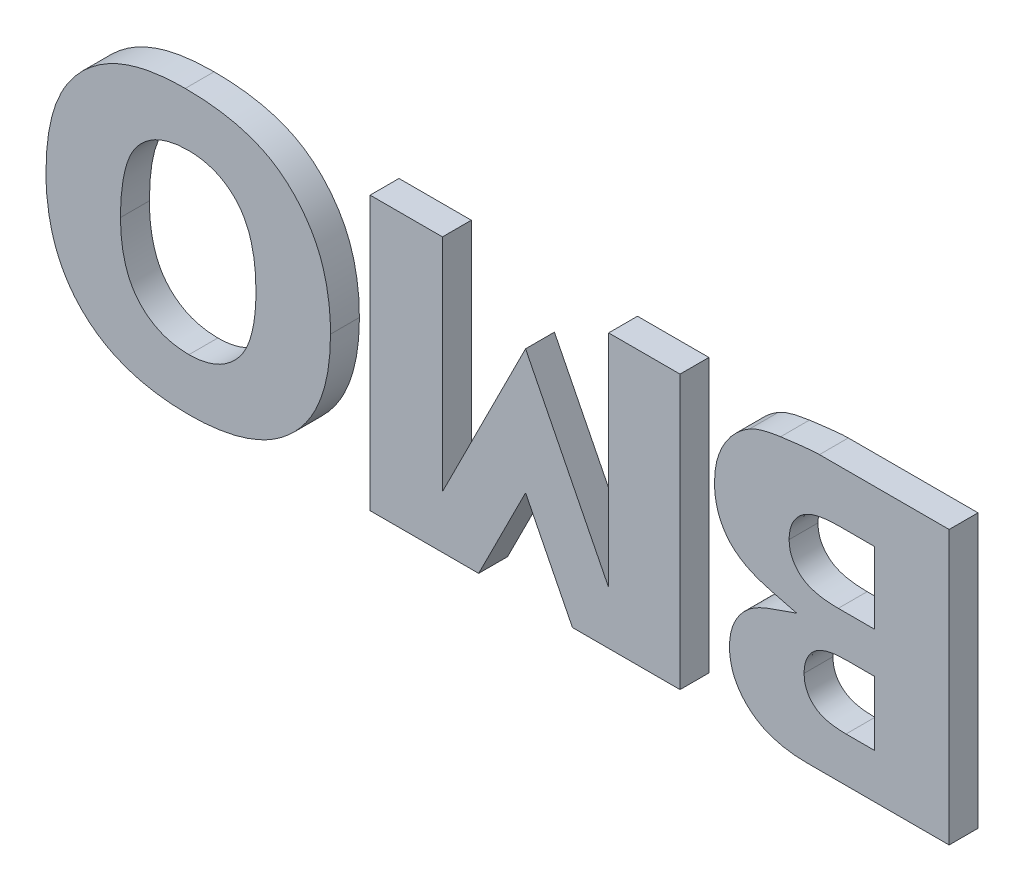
from build123d import *

# Parameters (mm, degrees)
BOSS_EXTRUDE1_DEPTH   = 1.905
BOSS_EXTRUDE1_2_DEPTH = 1.905
BOSS_EXTRUDE1_3_DEPTH = 1.905


with BuildPart() as part:
    # Sketch1 → Boss-Extrude1 (new body)
    with BuildSketch(Plane.XY):
        Polygon((-10.434858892, 29.6545), (-15.14635077, 29.6545), (-15.14635077, 15.099921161), (-20.628754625, 26.004552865), (-26.11073734, 15.100758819), (-26.113601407, 29.657575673), (-30.886935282, 29.657575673), (-30.886935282, 11.6205), (-23.723089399, 11.6205), (-20.628754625, 17.775205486), (-17.534419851, 11.6205), (-10.434858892, 11.6205), align=None)
    extrude(amount=BOSS_EXTRUDE1_DEPTH)


with BuildPart() as body_2:
    # Sketch1 → Boss-Extrude1 2 (new body)
    with BuildSketch(Plane.XY):
        with BuildLine():
            Line((7.324076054, 29.6545), (-1.232846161, 29.6545))
            add(Edge.make_bspline(
                [(-1.232846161, 29.6545), (-1.340451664, 29.652734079), (-1.448025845, 29.650456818), (-1.662660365, 29.637513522), (-1.769709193, 29.626659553), (-1.983964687, 29.607528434), (-2.091181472, 29.599042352), (-2.305176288, 29.577712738), (-2.411982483, 29.565233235), (-2.946001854, 29.502725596), (-3.372709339, 29.448541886), (-3.799192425, 29.392643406)],
                knots=[0, 0, 0, 0, 0.125, 0.125, 0.25, 0.25, 0.375, 0.375, 0.5, 0.5, 1, 1, 1, 1], degree=3))
            add(Edge.make_bspline(
                [(-3.799192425, 29.392643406), (-3.975707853, 29.366420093), (-4.152229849, 29.340236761), (-4.50347599, 29.276926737), (-4.677844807, 29.238639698), (-5.023145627, 29.149254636), (-5.195389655, 29.100743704), (-5.528733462, 28.978210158), (-5.68715284, 28.897015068), (-5.844918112, 28.814240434)],
                knots=[0, 0, 0, 0, 0.25, 0.25, 0.5, 0.5, 0.75, 0.75, 1, 1, 1, 1], degree=3))
            add(Edge.make_bspline(
                [(-5.844918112, 28.814240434), (-6.022643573, 28.700843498), (-6.200345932, 28.587419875), (-6.531611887, 28.332686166), (-6.685330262, 28.191554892), (-6.975239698, 27.8890438), (-7.112178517, 27.725868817), (-7.360003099, 27.384905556), (-7.471221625, 27.207585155), (-7.671080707, 26.840780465), (-7.759509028, 26.651181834), (-7.910483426, 26.258040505), (-7.973094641, 26.054163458), (-8.070425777, 25.645497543), (-8.105473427, 25.439126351), (-8.145486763, 25.02188151), (-8.152052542, 24.811247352), (-8.158667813, 24.600620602)],
                knots=[0, 0, 0, 0, 0.125, 0.125, 0.25, 0.25, 0.375, 0.375, 0.5, 0.5, 0.625, 0.625, 0.75, 0.75, 0.875, 0.875, 1, 1, 1, 1], degree=3))
            add(Edge.make_bspline(
                [(-8.158667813, 24.600620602), (-8.155423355, 24.433331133), (-8.151968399, 24.266074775), (-8.125448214, 23.934646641), (-8.103283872, 23.770333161), (-8.040581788, 23.444596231), (-8.000522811, 23.283097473), (-7.901749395, 22.963034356), (-7.842847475, 22.804611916), (-7.704246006, 22.50162102), (-7.626206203, 22.354894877), (-7.451536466, 22.071588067), (-7.350466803, 21.936377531), (-7.134260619, 21.67885318), (-7.019226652, 21.557844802), (-6.770300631, 21.33692521), (-6.637883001, 21.235364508), (-6.361585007, 21.045066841), (-6.218120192, 20.956278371), (-5.924164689, 20.799786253), (-5.773439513, 20.73035147), (-5.469092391, 20.598293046), (-5.314706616, 20.537465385), (-4.999740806, 20.430374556), (-4.839413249, 20.383441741), (-4.354226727, 20.252994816), (-4.02899144, 20.172973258), (-3.379948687, 20.007353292), (-3.05542731, 19.924543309), (-2.730905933, 19.841733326)],
                knots=[0, 0, 0, 0, 0.0625, 0.0625, 0.125, 0.125, 0.1875, 0.1875, 0.25, 0.25, 0.3125, 0.3125, 0.375, 0.375, 0.4375, 0.4375, 0.5, 0.5, 0.5625, 0.5625, 0.625, 0.625, 0.6875, 0.6875, 0.75, 0.75, 0.875, 0.875, 1, 1, 1, 1], degree=3))
            add(Edge.make_bspline(
                [(-2.730905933, 19.841733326), (-3.038815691, 19.733224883), (-3.346725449, 19.624716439), (-3.962544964, 19.407699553), (-4.271391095, 19.30179885), (-4.731289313, 19.133559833), (-4.883396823, 19.074016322), (-5.179220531, 18.93751505), (-5.323960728, 18.86129546), (-5.605113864, 18.696948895), (-5.741286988, 18.60901494), (-5.993355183, 18.406618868), (-6.109227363, 18.292126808), (-6.225249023, 18.177830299)],
                knots=[0, 0, 0, 0, 0.25, 0.25, 0.5, 0.5, 0.625, 0.625, 0.75, 0.75, 0.875, 0.875, 1, 1, 1, 1], degree=3))
            add(Edge.make_bspline(
                [(-6.225249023, 18.177830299), (-6.299789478, 18.092960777), (-6.374277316, 18.008051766), (-6.513898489, 17.831213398), (-6.578705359, 17.739039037), (-6.759970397, 17.452642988), (-6.859361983, 17.249825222), (-7.017937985, 16.8323127), (-7.077155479, 16.614810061), (-7.13476986, 16.280778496), (-7.149076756, 16.168986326), (-7.164799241, 15.944222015), (-7.166926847, 15.831315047), (-7.169083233, 15.718410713)],
                knots=[0, 0, 0, 0, 0.125, 0.125, 0.25, 0.25, 0.5, 0.5, 0.75, 0.75, 0.875, 0.875, 1, 1, 1, 1], degree=3))
            add(Edge.make_bspline(
                [(-7.169083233, 15.718410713), (-7.164949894, 15.562943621), (-7.160894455, 15.407463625), (-7.129626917, 15.100339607), (-7.103282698, 14.94855182), (-7.035273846, 14.64751412), (-6.993083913, 14.498146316), (-6.887720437, 14.203722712), (-6.824357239, 14.062922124), (-6.606316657, 13.657297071), (-6.433652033, 13.403198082), (-6.021978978, 12.935104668), (-5.792824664, 12.728765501), (-5.41658357, 12.457886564), (-5.284740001, 12.373846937), (-5.014258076, 12.222487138), (-4.875614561, 12.154982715), (-4.450597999, 11.974300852), (-4.153972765, 11.88105243), (-3.551541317, 11.739067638), (-3.247593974, 11.691694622), (-2.635737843, 11.631201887), (-2.327040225, 11.624902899), (-2.018123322, 11.6205)],
                knots=[0, 0, 0, 0, 0.0625, 0.0625, 0.125, 0.125, 0.1875, 0.1875, 0.25, 0.25, 0.375, 0.375, 0.5, 0.5, 0.5625, 0.5625, 0.625, 0.625, 0.75, 0.75, 0.875, 0.875, 1, 1, 1, 1], degree=3))
            Line((-2.018123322, 11.6205), (7.324076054, 11.6205))
            Line((7.324076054, 11.6205), (7.324076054, 29.6545))
        make_face()
        with BuildLine():
            Line((0.008809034, 21.490214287), (2.402413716, 21.490214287))
            Line((2.402413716, 21.490214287), (2.402413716, 26.217253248))
            Line((2.402413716, 26.217253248), (-0.003192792, 26.217253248))
            add(Edge.make_bspline(
                [(-0.003192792, 26.217253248), (-0.195005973, 26.214842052), (-0.386748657, 26.211812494), (-0.767862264, 26.184949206), (-0.957261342, 26.16136244), (-1.333348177, 26.090406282), (-1.522522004, 26.047652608), (-1.884598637, 25.924519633), (-2.057359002, 25.843305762), (-2.3838018, 25.636604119), (-2.529834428, 25.51465144), (-2.787438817, 25.233452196), (-2.898318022, 25.072688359), (-3.072020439, 24.733217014), (-3.138477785, 24.549932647), (-3.218617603, 24.176318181), (-3.228766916, 23.985120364), (-3.237822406, 23.793762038)],
                knots=[0, 0, 0, 0, 0.125, 0.125, 0.25, 0.25, 0.375, 0.375, 0.5, 0.5, 0.625, 0.625, 0.75, 0.75, 0.875, 0.875, 1, 1, 1, 1], degree=3))
            add(Edge.make_bspline(
                [(-3.237822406, 23.793762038), (-3.227447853, 23.605661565), (-3.215531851, 23.417820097), (-3.129949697, 23.052512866), (-3.05919665, 22.873294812), (-2.873160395, 22.549920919), (-2.757336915, 22.39996529), (-2.491597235, 22.131797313), (-2.34382411, 22.016530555), (-2.0161099, 21.826613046), (-1.841662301, 21.755444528), (-1.484775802, 21.643102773), (-1.300331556, 21.60175561), (-0.928709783, 21.541148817), (-0.742049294, 21.520941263), (-0.367481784, 21.49533872), (-0.179378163, 21.492279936), (0.008809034, 21.490214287)],
                knots=[0, 0, 0, 0, 0.125, 0.125, 0.25, 0.25, 0.375, 0.375, 0.5, 0.5, 0.625, 0.625, 0.75, 0.75, 0.875, 0.875, 1, 1, 1, 1], degree=3))
        make_face(mode=Mode.SUBTRACT)
        with BuildLine():
            Line((0.519570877, 14.56294156), (2.402413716, 14.56294156))
            Line((2.402413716, 14.56294156), (2.402413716, 18.795175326))
            Line((2.402413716, 18.795175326), (0.556506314, 18.795175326))
            add(Edge.make_bspline(
                [(0.556506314, 18.795175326), (0.220122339, 18.789857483), (-0.116200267, 18.777252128), (-0.614219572, 18.690310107), (-0.775309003, 18.647361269), (-1.090286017, 18.541004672), (-1.24362488, 18.474449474), (-1.529930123, 18.289956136), (-1.656218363, 18.179137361), (-1.877842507, 17.923413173), (-1.970344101, 17.780025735), (-2.115432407, 17.475827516), (-2.169418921, 17.312866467), (-2.233575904, 16.982835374), (-2.241382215, 16.812980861), (-2.247962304, 16.643492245)],
                knots=[0, 0, 0, 0, 0.25, 0.25, 0.375, 0.375, 0.5, 0.5, 0.625, 0.625, 0.75, 0.75, 0.875, 0.875, 1, 1, 1, 1], degree=3))
            add(Edge.make_bspline(
                [(-2.247962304, 16.643492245), (-2.241092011, 16.479436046), (-2.232848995, 16.315601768), (-2.166127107, 15.996054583), (-2.109971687, 15.837916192), (-1.961134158, 15.546246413), (-1.86709707, 15.40915654), (-1.646497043, 15.1647265), (-1.521439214, 15.05959425), (-1.10213305, 14.795282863), (-0.783608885, 14.697712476), (-0.136636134, 14.582283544), (0.191303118, 14.570903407), (0.519570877, 14.56294156)],
                knots=[0, 0, 0, 0, 0.125, 0.125, 0.25, 0.25, 0.375, 0.375, 0.5, 0.5, 0.75, 0.75, 1, 1, 1, 1], degree=3))
        make_face(mode=Mode.SUBTRACT)
    extrude(amount=BOSS_EXTRUDE1_2_DEPTH)


with BuildPart() as body_3:
    # Sketch1 → Boss-Extrude1 3 (new body)
    with BuildSketch(Plane.XY):
        with BuildLine():
            add(Edge.make_bspline(
                [(-43.089075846, 29.654456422), (-43.402321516, 29.649715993), (-43.71551268, 29.644608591), (-44.338058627, 29.60856462), (-44.64760656, 29.578928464), (-45.570999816, 29.454669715), (-46.180387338, 29.330034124), (-47.078272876, 29.034039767), (-47.372477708, 28.919099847), (-47.94108624, 28.658627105), (-48.216901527, 28.512713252), (-48.749440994, 28.185628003), (-49.006068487, 28.002658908), (-49.502319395, 27.612185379), (-49.734512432, 27.402668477), (-50.166847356, 26.954907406), (-50.369000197, 26.718465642), (-50.744392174, 26.219666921), (-50.917771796, 25.954762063), (-51.232825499, 25.410944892), (-51.369431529, 25.130248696), (-51.612455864, 24.556176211), (-51.717371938, 24.262168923), (-51.894094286, 23.660246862), (-51.968059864, 23.353054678), (-52.088726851, 22.738513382), (-52.136427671, 22.429822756), (-52.210844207, 21.810082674), (-52.23606837, 21.498865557), (-52.266842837, 20.874219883), (-52.272039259, 20.560751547), (-52.277060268, 20.247263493)],
                knots=[0, 0, 0, 0, 0.0625, 0.0625, 0.125, 0.125, 0.25, 0.25, 0.3125, 0.3125, 0.375, 0.375, 0.4375, 0.4375, 0.5, 0.5, 0.5625, 0.5625, 0.625, 0.625, 0.6875, 0.6875, 0.75, 0.75, 0.8125, 0.8125, 0.875, 0.875, 0.9375, 0.9375, 1, 1, 1, 1], degree=3))
            add(Edge.make_bspline(
                [(-52.277060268, 20.247263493), (-52.271831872, 19.93581922), (-52.266599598, 19.624375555), (-52.231014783, 19.005433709), (-52.198755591, 18.698234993), (-52.066562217, 17.782201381), (-51.936811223, 17.178049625), (-51.639490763, 16.287951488), (-51.523847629, 15.995465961), (-51.261758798, 15.431601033), (-51.114654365, 15.158590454), (-50.787742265, 14.630737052), (-50.607832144, 14.375385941), (-50.211194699, 13.887460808), (-49.998643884, 13.659782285), (-49.549700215, 13.231704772), (-49.312936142, 13.03173052), (-48.812440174, 12.662637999), (-48.547300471, 12.492138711), (-47.728289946, 12.03212386), (-47.152821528, 11.79626023), (-46.255153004, 11.525306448), (-45.94971348, 11.449373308), (-45.338355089, 11.324975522), (-45.031210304, 11.275273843), (-44.414527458, 11.196278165), (-44.104844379, 11.168220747), (-43.482615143, 11.136519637), (-43.17027293, 11.131136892), (-42.857929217, 11.125766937)],
                knots=[0, 0, 0, 0, 0.0625, 0.0625, 0.125, 0.125, 0.25, 0.25, 0.3125, 0.3125, 0.375, 0.375, 0.4375, 0.4375, 0.5, 0.5, 0.5625, 0.5625, 0.625, 0.625, 0.75, 0.75, 0.8125, 0.8125, 0.875, 0.875, 0.9375, 0.9375, 1, 1, 1, 1], degree=3))
            add(Edge.make_bspline(
                [(-42.857929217, 11.125766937), (-42.545504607, 11.130929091), (-42.233081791, 11.136103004), (-41.611846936, 11.170125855), (-41.303327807, 11.200895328), (-40.383111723, 11.328225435), (-39.775819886, 11.453669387), (-38.879733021, 11.739209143), (-38.584361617, 11.850446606), (-38.012850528, 12.101176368), (-37.734630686, 12.240519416), (-37.196876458, 12.553865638), (-36.938053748, 12.729188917), (-36.438250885, 13.112932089), (-36.20001838, 13.318222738), (-35.531722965, 13.971629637), (-35.144665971, 14.461828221), (-34.488283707, 15.539042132), (-34.234808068, 16.108935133), (-33.941640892, 17.00022402), (-33.858001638, 17.304668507), (-33.719518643, 17.916747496), (-33.664424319, 18.224442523), (-33.579611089, 18.842802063), (-33.550237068, 19.153506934), (-33.5150804, 19.77767739), (-33.508027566, 20.090994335), (-33.500990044, 20.404313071)],
                knots=[0, 0, 0, 0, 0.0625, 0.0625, 0.125, 0.125, 0.25, 0.25, 0.3125, 0.3125, 0.375, 0.375, 0.4375, 0.4375, 0.5, 0.5, 0.625, 0.625, 0.75, 0.75, 0.8125, 0.8125, 0.875, 0.875, 0.9375, 0.9375, 1, 1, 1, 1], degree=3))
            add(Edge.make_bspline(
                [(-33.500990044, 20.404313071), (-33.504846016, 20.721659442), (-33.509171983, 21.038930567), (-33.548108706, 21.668624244), (-33.580265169, 21.981439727), (-33.7113677, 22.914341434), (-33.845968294, 23.528719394), (-34.14771378, 24.434301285), (-34.265325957, 24.733047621), (-34.535833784, 25.305342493), (-34.68988409, 25.580618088), (-35.024114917, 26.116055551), (-35.205462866, 26.375542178), (-35.604142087, 26.873702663), (-35.81892066, 27.109790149), (-36.268800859, 27.553447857), (-36.505443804, 27.761505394), (-37.00693018, 28.144435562), (-37.273281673, 28.31799749), (-38.111617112, 28.789628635), (-38.701349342, 29.021014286), (-39.619168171, 29.278653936), (-39.931202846, 29.35130091), (-40.556983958, 29.470085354), (-40.871162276, 29.516551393), (-41.501427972, 29.590320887), (-41.817657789, 29.61619458), (-42.452211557, 29.646921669), (-42.770628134, 29.650845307), (-43.089075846, 29.654456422)],
                knots=[0, 0, 0, 0, 0.0625, 0.0625, 0.125, 0.125, 0.25, 0.25, 0.3125, 0.3125, 0.375, 0.375, 0.4375, 0.4375, 0.5, 0.5, 0.5625, 0.5625, 0.625, 0.625, 0.75, 0.75, 0.8125, 0.8125, 0.875, 0.875, 0.9375, 0.9375, 1, 1, 1, 1], degree=3))
        make_face()
        with BuildLine():
            add(Edge.make_bspline(
                [(-38.422553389, 20.401693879), (-38.426323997, 20.750421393), (-38.432183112, 21.098900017), (-38.487099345, 21.79070933), (-38.531477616, 22.134597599), (-38.629317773, 22.646703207), (-38.667221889, 22.816774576), (-38.75503709, 23.155486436), (-38.80516785, 23.323873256), (-38.923808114, 23.651186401), (-38.992453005, 23.810725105), (-39.145042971, 24.123045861), (-39.22892354, 24.275971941), (-39.51622898, 24.718301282), (-39.745921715, 24.976560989), (-40.135117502, 25.32108367), (-40.274051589, 25.428938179), (-40.56528528, 25.622318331), (-40.716213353, 25.708127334), (-41.183556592, 25.935727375), (-41.519629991, 26.046496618), (-42.030269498, 26.151826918), (-42.2017573, 26.177792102), (-42.547609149, 26.209086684), (-42.722123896, 26.213334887), (-42.89666582, 26.217388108)],
                knots=[0, 0, 0, 0, 0.125, 0.125, 0.25, 0.25, 0.3125, 0.3125, 0.375, 0.375, 0.4375, 0.4375, 0.5, 0.5, 0.625, 0.625, 0.6875, 0.6875, 0.75, 0.75, 0.875, 0.875, 0.9375, 0.9375, 1, 1, 1, 1], degree=3))
            add(Edge.make_bspline(
                [(-42.89666582, 26.217388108), (-43.076205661, 26.21328257), (-43.255698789, 26.208930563), (-43.610261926, 26.176889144), (-43.785587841, 26.150549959), (-44.133124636, 26.081435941), (-44.305193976, 26.037914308), (-44.64483684, 25.927150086), (-44.813980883, 25.859394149), (-45.300369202, 25.622622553), (-45.595697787, 25.420393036), (-46.130561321, 24.930341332), (-46.360349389, 24.655266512), (-46.631964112, 24.18809553), (-46.711214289, 24.023472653), (-46.850351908, 23.691439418), (-46.910740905, 23.522588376), (-47.070860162, 23.009536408), (-47.147313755, 22.657478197), (-47.260159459, 21.943861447), (-47.298280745, 21.585698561), (-47.347045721, 20.86733915), (-47.352100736, 20.506729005), (-47.355493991, 20.145995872)],
                knots=[0, 0, 0, 0, 0.0625, 0.0625, 0.125, 0.125, 0.1875, 0.1875, 0.25, 0.25, 0.375, 0.375, 0.5, 0.5, 0.5625, 0.5625, 0.625, 0.625, 0.75, 0.75, 0.875, 0.875, 1, 1, 1, 1], degree=3))
            add(Edge.make_bspline(
                [(-47.355493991, 20.145995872), (-47.351555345, 19.807318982), (-47.344827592, 19.469121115), (-47.285852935, 18.800543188), (-47.24001617, 18.469062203), (-47.099018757, 17.814571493), (-47.007229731, 17.490982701), (-46.8197467, 17.01415246), (-46.748232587, 16.856744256), (-46.58833805, 16.555602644), (-46.49962956, 16.410653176), (-46.205248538, 15.993933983), (-45.967664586, 15.739052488), (-45.576342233, 15.411561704), (-45.439494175, 15.310633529), (-45.151560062, 15.127077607), (-44.998774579, 15.044906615), (-44.68715996, 14.901779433), (-44.52863866, 14.838170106), (-44.204405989, 14.732024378), (-44.037987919, 14.691559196), (-43.699621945, 14.626835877), (-43.528921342, 14.601382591), (-43.186551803, 14.570888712), (-43.014396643, 14.5667754), (-42.842229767, 14.562796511)],
                knots=[0, 0, 0, 0, 0.125, 0.125, 0.25, 0.25, 0.375, 0.375, 0.4375, 0.4375, 0.5, 0.5, 0.625, 0.625, 0.6875, 0.6875, 0.75, 0.75, 0.8125, 0.8125, 0.875, 0.875, 0.9375, 0.9375, 1, 1, 1, 1], degree=3))
            add(Edge.make_bspline(
                [(-42.842229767, 14.562796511), (-42.668364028, 14.567093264), (-42.494544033, 14.571689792), (-42.150629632, 14.605297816), (-41.980293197, 14.632723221), (-41.642364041, 14.705554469), (-41.474030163, 14.752142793), (-41.145161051, 14.868868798), (-40.986275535, 14.937623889), (-40.678871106, 15.094548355), (-40.530340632, 15.182696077), (-40.244256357, 15.379548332), (-40.106570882, 15.489151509), (-39.720799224, 15.838053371), (-39.495138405, 16.099644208), (-39.117638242, 16.690317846), (-38.971775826, 17.004862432), (-38.739012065, 17.660358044), (-38.654847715, 18.00019724), (-38.529203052, 18.679005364), (-38.485390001, 19.020761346), (-38.431959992, 19.708504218), (-38.426302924, 20.054981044), (-38.422553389, 20.401693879)],
                knots=[0, 0, 0, 0, 0.0625, 0.0625, 0.125, 0.125, 0.1875, 0.1875, 0.25, 0.25, 0.3125, 0.3125, 0.375, 0.375, 0.5, 0.5, 0.625, 0.625, 0.75, 0.75, 0.875, 0.875, 1, 1, 1, 1], degree=3))
        make_face(mode=Mode.SUBTRACT)
    extrude(amount=BOSS_EXTRUDE1_3_DEPTH)


solid = Compound([part.part, body_2.part, body_3.part])
